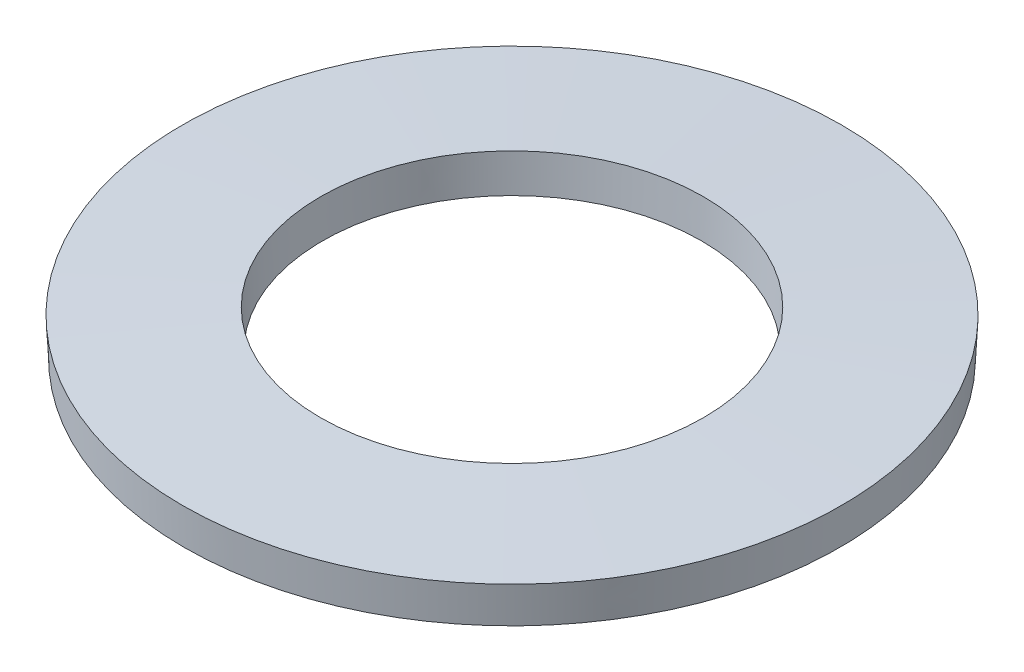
ISO-10303-21;
HEADER;
FILE_DESCRIPTION(('STEP AP214'),'2;1');
FILE_NAME('part.step','',(''),(''),'','','');
FILE_SCHEMA(('AUTOMOTIVE_DESIGN { 1 0 10303 214 1 1 1 1 }'));
ENDSEC;
DATA;
#1=APPLICATION_CONTEXT('core data for automotive mechanical design processes');
#2=APPLICATION_PROTOCOL_DEFINITION('international standard','automotive_design',2000,#1);
#3=PRODUCT_CONTEXT('',#1,'mechanical');
#4=PRODUCT('Part','Part','',(#3));
#5=PRODUCT_RELATED_PRODUCT_CATEGORY('part','',(#4));
#6=PRODUCT_DEFINITION_FORMATION('','',#4);
#7=PRODUCT_DEFINITION_CONTEXT('part definition',#1,'design');
#8=PRODUCT_DEFINITION('design','',#6,#7);
#9=PRODUCT_DEFINITION_SHAPE('','',#8);
#10=(LENGTH_UNIT() NAMED_UNIT(*) SI_UNIT(.MILLI.,.METRE.));
#11=(NAMED_UNIT(*) PLANE_ANGLE_UNIT() SI_UNIT($,.RADIAN.));
#12=(NAMED_UNIT(*) SI_UNIT($,.STERADIAN.) SOLID_ANGLE_UNIT());
#13=UNCERTAINTY_MEASURE_WITH_UNIT(LENGTH_MEASURE(1.E-05),#10,'distance_accuracy_value','');
#14=(GEOMETRIC_REPRESENTATION_CONTEXT(3) GLOBAL_UNCERTAINTY_ASSIGNED_CONTEXT((#13)) GLOBAL_UNIT_ASSIGNED_CONTEXT((#10,
#11,#12)) REPRESENTATION_CONTEXT('',''));
#15=CARTESIAN_POINT('',(0.,0.,0.));
#16=DIRECTION('',(0.,0.,1.));
#17=DIRECTION('',(1.,0.,0.));
#18=AXIS2_PLACEMENT_3D('',#15,#16,#17);
#19=CARTESIAN_POINT('',(0.,3.99497552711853,0.));
#20=DIRECTION('',(0.,1.,0.));
#21=DIRECTION('',(0.,0.,1.));
#22=AXIS2_PLACEMENT_3D('',#19,#20,#21);
#23=CONICAL_SURFACE('',#22,35.2004258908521,0.0501274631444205);
#24=CARTESIAN_POINT('',(0.,0.,0.));
#25=DIRECTION('',(0.,-1.,0.));
#26=DIRECTION('',(0.,0.,-1.));
#27=AXIS2_PLACEMENT_3D('',#24,#25,#26);
#28=CIRCLE('',#27,35.);
#29=CARTESIAN_POINT('',(0.,0.,-35.));
#30=VERTEX_POINT('',#29);
#31=EDGE_CURVE('E47',#30,#30,#28,.T.);
#32=ORIENTED_EDGE('',*,*,#31,.F.);
#33=EDGE_LOOP('',(#32));
#34=FACE_BOUND('',#33,.T.);
#35=CARTESIAN_POINT('',(0.,3.99497552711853,0.));
#36=DIRECTION('',(0.,-1.,0.));
#37=DIRECTION('',(0.,0.,-1.));
#38=AXIS2_PLACEMENT_3D('',#35,#36,#37);
#39=CIRCLE('',#38,35.2004258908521);
#40=CARTESIAN_POINT('',(0.,3.99497552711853,-35.2004258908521));
#41=VERTEX_POINT('',#40);
#42=EDGE_CURVE('E10',#41,#41,#39,.T.);
#43=ORIENTED_EDGE('',*,*,#42,.T.);
#44=EDGE_LOOP('',(#43));
#45=FACE_BOUND('',#44,.T.);
#46=ADVANCED_FACE('F33',(#34,#45),#23,.T.);
#47=CARTESIAN_POINT('',(0.,4.73497552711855,0.));
#48=DIRECTION('',(0.,-1.,0.));
#49=DIRECTION('',(0.,0.,-1.));
#50=AXIS2_PLACEMENT_3D('',#47,#48,#49);
#51=CONICAL_SURFACE('',#50,20.4504258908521,1.52066886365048);
#52=ORIENTED_EDGE('',*,*,#42,.F.);
#53=EDGE_LOOP('',(#52));
#54=FACE_BOUND('',#53,.T.);
#55=CARTESIAN_POINT('',(0.,4.73497552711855,0.));
#56=DIRECTION('',(0.,-1.,0.));
#57=DIRECTION('',(0.,0.,-1.));
#58=AXIS2_PLACEMENT_3D('',#55,#56,#57);
#59=CIRCLE('',#58,20.4504258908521);
#60=CARTESIAN_POINT('',(0.,4.73497552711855,-20.4504258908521));
#61=VERTEX_POINT('',#60);
#62=EDGE_CURVE('E39',#61,#61,#59,.T.);
#63=ORIENTED_EDGE('',*,*,#62,.T.);
#64=EDGE_LOOP('',(#63));
#65=FACE_BOUND('',#64,.T.);
#66=ADVANCED_FACE('F56',(#54,#65),#51,.T.);
#67=CARTESIAN_POINT('',(0.,0.740000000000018,0.));
#68=DIRECTION('',(0.,1.,0.));
#69=DIRECTION('',(0.,0.,1.));
#70=AXIS2_PLACEMENT_3D('',#67,#68,#69);
#71=CONICAL_SURFACE('',#70,20.25,0.0501274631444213);
#72=ORIENTED_EDGE('',*,*,#62,.F.);
#73=EDGE_LOOP('',(#72));
#74=FACE_BOUND('',#73,.T.);
#75=CARTESIAN_POINT('',(0.,0.740000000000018,0.));
#76=DIRECTION('',(0.,-1.,0.));
#77=DIRECTION('',(0.,0.,-1.));
#78=AXIS2_PLACEMENT_3D('',#75,#76,#77);
#79=CIRCLE('',#78,20.25);
#80=CARTESIAN_POINT('',(0.,0.740000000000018,-20.25));
#81=VERTEX_POINT('',#80);
#82=EDGE_CURVE('E43',#81,#81,#79,.T.);
#83=ORIENTED_EDGE('',*,*,#82,.T.);
#84=EDGE_LOOP('',(#83));
#85=FACE_BOUND('',#84,.T.);
#86=ADVANCED_FACE('F60',(#74,#85),#71,.F.);
#87=CARTESIAN_POINT('',(0.,0.,0.));
#88=DIRECTION('',(0.,-1.,0.));
#89=DIRECTION('',(0.,0.,-1.));
#90=AXIS2_PLACEMENT_3D('',#87,#88,#89);
#91=CONICAL_SURFACE('',#90,35.,1.52066886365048);
#92=ORIENTED_EDGE('',*,*,#82,.F.);
#93=EDGE_LOOP('',(#92));
#94=FACE_BOUND('',#93,.T.);
#95=ORIENTED_EDGE('',*,*,#31,.T.);
#96=EDGE_LOOP('',(#95));
#97=FACE_BOUND('',#96,.T.);
#98=ADVANCED_FACE('F53',(#94,#97),#91,.F.);
#99=CLOSED_SHELL('',(#46,#66,#86,#98));
#100=MANIFOLD_SOLID_BREP('B2',#99);
#101=ADVANCED_BREP_SHAPE_REPRESENTATION('',(#18,#100),#14);
#102=SHAPE_DEFINITION_REPRESENTATION(#9,#101);
ENDSEC;
END-ISO-10303-21;
